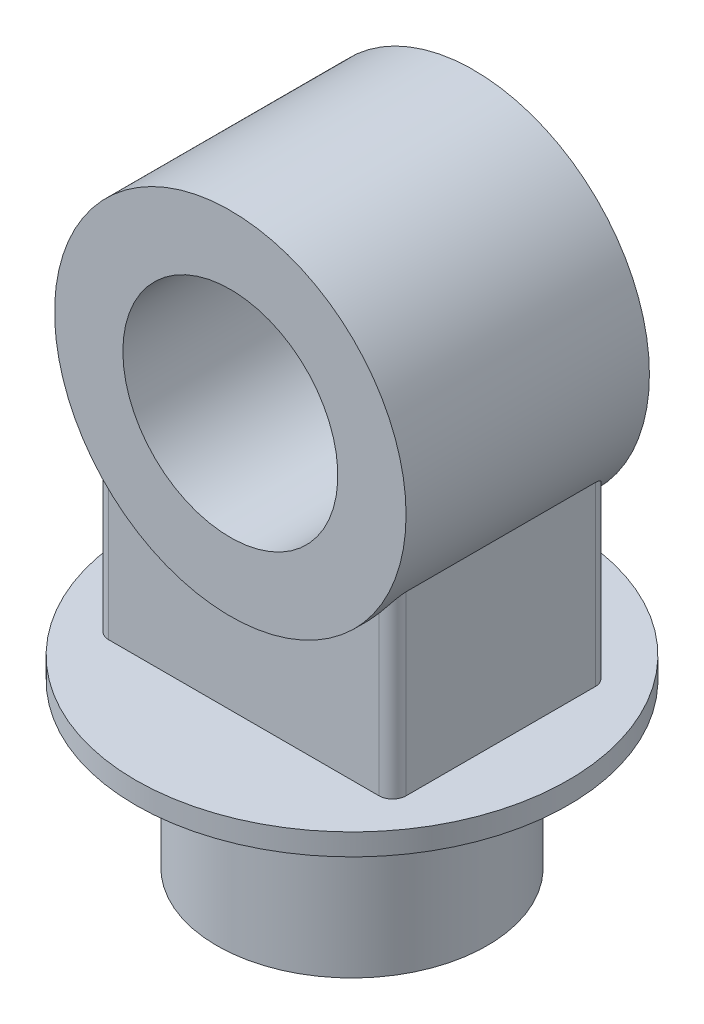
from build123d import *

# Parameters (mm, degrees)
SKETCH1_R                = 100
BOSS_EXTRUDE1_DEPTH      = 120
SKETCH2_R                = 160
BOSS_EXTRUDE2_DEPTH      = 16
SKETCH3_R                = 130
SKETCH3_R_2              = 79.5
BOSS_EXTRUDE3_DEPTH      = 90
BOSS_EXTRUDE4_REACH      = 402.125
BOSS_EXTRUDE4_END_RADIUS = 130
SKETCH4_W                = 220
SKETCH4_H                = 160
FILLET1_R                = 10


with BuildPart() as part:
    # Sketch1 → Boss-Extrude1 (new body)
    with BuildSketch(Plane(origin=(0, 0, 0), x_dir=(1, 0, 0), z_dir=(0, 1, 0))):
        with Locations(Location((0, 0, 0), (0, 0, 270))):
            Circle(SKETCH1_R)
    extrude(amount=BOSS_EXTRUDE1_DEPTH)

    # Sketch2 → Boss-Extrude2 (add)
    with BuildSketch(Plane(origin=(0, 120, 0), x_dir=(1, 0, 0), z_dir=(0, 1, 0))):
        with Locations(Location((0, 0, 0), (0, 0, 270))):
            Circle(SKETCH2_R)
    extrude(amount=BOSS_EXTRUDE2_DEPTH)



with BuildPart() as body_2:
    # Sketch3 → Boss-Extrude3 (new, symmetric)
    with BuildSketch(Plane.XY):
        with Locations(Location((0, 336, 0), (0, 0, 180))):
            Circle(SKETCH3_R)
        with Locations(Location((0, 336, 0), (0, 0, 180))):
            Circle(SKETCH3_R_2, mode=Mode.SUBTRACT)
    extrude(amount=BOSS_EXTRUDE3_DEPTH, both=True)


with BuildPart() as part_1:
    add(part.part)

    add(body_2.part)  # Boss-Extrude4 merges body 2
    # Boss-Extrude4: up to this cylinder (the profile starts outside it)
    boss_extrude4_end = Plane(origin=(0, 336, 0), z_dir=(0, 0, -1)) * Cylinder(BOSS_EXTRUDE4_END_RADIUS, 1065.25, mode=Mode.PRIVATE)
    # Sketch4 → Boss-Extrude4 (add, up to the surface)
    with BuildSketch(Plane(origin=(0, 136, 0), x_dir=(1, 0, 0), z_dir=(0, 1, 0)), mode=Mode.PRIVATE) as boss_extrude4_sk1:
        Rectangle(SKETCH4_W, SKETCH4_H)
    boss_extrude4_tool1 = extrude(boss_extrude4_sk1.sketch, amount=BOSS_EXTRUDE4_REACH, mode=Mode.PRIVATE) - boss_extrude4_end
    add(boss_extrude4_tool1.solids().sort_by_distance((0, 136, 0))[0])

    # Fillet1
    fillet1_edges = [part_1.edges().sort_by_distance(p)[0] for p in [
        (110, 201.358983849, -80),
        (110, 201.358983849, 80),
        (-110, 201.358983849, -80),
        (-110, 201.358983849, 80),
    ]]
    fillet(fillet1_edges, radius=FILLET1_R)


solid = part_1.part
